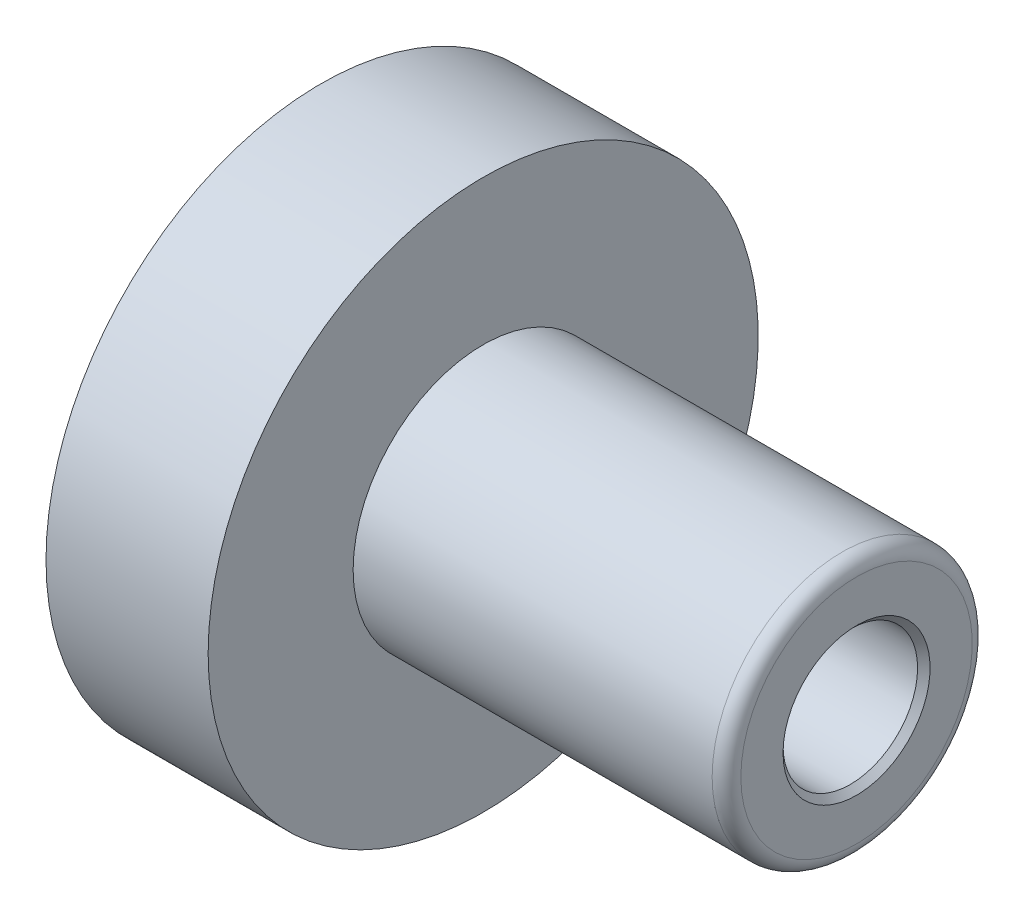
from build123d import *

# Parameters (mm, degrees)
SKETCH2_R          = 3.2004
CUT_EXTRUDE1_DEPTH = 7.9502
SKETCH3_R          = 7.3787
CUT_EXTRUDE2_DEPTH = 22.8092
CHAMFER1_SIZE      = 0.6858


with BuildPart() as part:
    # Sketch1 → Revolve1 (revolve)
    with BuildSketch(Plane.XY, mode=Mode.PRIVATE) as revolve1_sk:
        with BuildLine():
            Line((0, 9.906), (0, 30.1625))
            Line((0, 30.1625), (17.78, 30.1625))
            Line((17.78, 30.1625), (17.78, 14.2621))
            Line((17.78, 14.2621), (57.15, 14.2621))
            ThreePointArc((57.15, 14.2621), (58.263551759, 13.800851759), (58.7248, 12.6873))
            Line((58.7248, 12.6873), (58.7248, 0))
            Line((58.7248, 0), (33.3502, 0))
            Line((33.3502, 0), (33.3502, 9.906))
            Line((33.3502, 9.906), (0, 9.906))
        make_face()
    revolve(revolve1_sk.sketch.rotate(Axis((0, 0, 0), (1, 0, 0)), 90), axis=Axis((0, 0, 0), (1, 0, 0)))

    # Sketch2 → Cut-Extrude1 (cut)
    with BuildSketch(Plane.ZY):
        with Locations((0, 19.939)):
            Circle(SKETCH2_R)
        with Locations(Location((0, -19.939, 0), (0, 0, 180))):
            Circle(SKETCH2_R)
    extrude(amount=-CUT_EXTRUDE1_DEPTH, mode=Mode.SUBTRACT)

    # Sketch3 → Cut-Extrude2 (cut)
    with BuildSketch(Plane(origin=(58.7248, 0, 0), x_dir=(0, 0, -1), z_dir=(1, 0, 0))):
        Circle(SKETCH3_R)
    extrude(amount=-CUT_EXTRUDE2_DEPTH, mode=Mode.SUBTRACT)

    # Chamfer1
    chamfer1_edges = [part.edges().sort_by_distance(p)[0] for p in [
        (58.7248, 0, 7.3787),
    ]]
    chamfer(chamfer1_edges, length=CHAMFER1_SIZE)


solid = part.part
